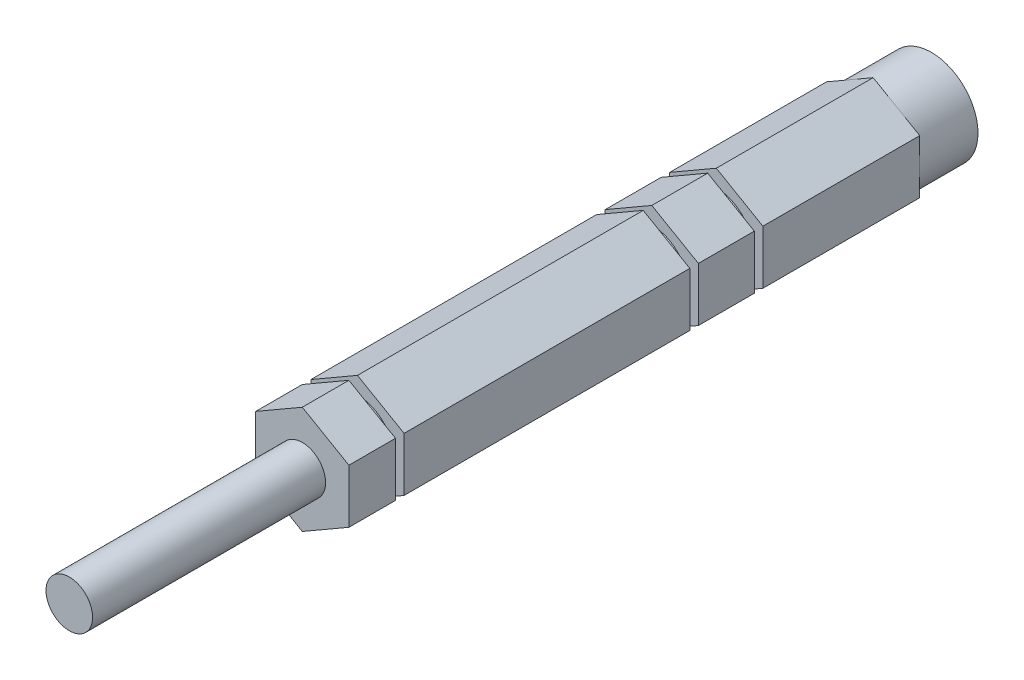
ISO-10303-21;
HEADER;
FILE_DESCRIPTION(('STEP AP214'),'2;1');
FILE_NAME('part.step','',(''),(''),'','','');
FILE_SCHEMA(('AUTOMOTIVE_DESIGN { 1 0 10303 214 1 1 1 1 }'));
ENDSEC;
DATA;
#1=APPLICATION_CONTEXT('core data for automotive mechanical design processes');
#2=APPLICATION_PROTOCOL_DEFINITION('international standard','automotive_design',2000,#1);
#3=PRODUCT_CONTEXT('',#1,'mechanical');
#4=PRODUCT('Part','Part','',(#3));
#5=PRODUCT_RELATED_PRODUCT_CATEGORY('part','',(#4));
#6=PRODUCT_DEFINITION_FORMATION('','',#4);
#7=PRODUCT_DEFINITION_CONTEXT('part definition',#1,'design');
#8=PRODUCT_DEFINITION('design','',#6,#7);
#9=PRODUCT_DEFINITION_SHAPE('','',#8);
#10=(LENGTH_UNIT() NAMED_UNIT(*) SI_UNIT(.MILLI.,.METRE.));
#11=(NAMED_UNIT(*) PLANE_ANGLE_UNIT() SI_UNIT($,.RADIAN.));
#12=(NAMED_UNIT(*) SI_UNIT($,.STERADIAN.) SOLID_ANGLE_UNIT());
#13=UNCERTAINTY_MEASURE_WITH_UNIT(LENGTH_MEASURE(1.E-05),#10,'distance_accuracy_value','');
#14=(GEOMETRIC_REPRESENTATION_CONTEXT(3) GLOBAL_UNCERTAINTY_ASSIGNED_CONTEXT((#13)) GLOBAL_UNIT_ASSIGNED_CONTEXT((#10,
#11,#12)) REPRESENTATION_CONTEXT('',''));
#15=CARTESIAN_POINT('',(0.,0.,0.));
#16=DIRECTION('',(0.,0.,1.));
#17=DIRECTION('',(1.,0.,0.));
#18=AXIS2_PLACEMENT_3D('',#15,#16,#17);
#19=CARTESIAN_POINT('',(6.35,3.66617420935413,117.475));
#20=DIRECTION('',(-0.5,-0.866025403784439,0.));
#21=DIRECTION('',(0.866025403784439,-0.5,0.));
#22=AXIS2_PLACEMENT_3D('',#19,#20,#21);
#23=PLANE('',#22);
#24=DIRECTION('',(-0.866025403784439,0.5,0.));
#25=VECTOR('',#24,1.);
#26=CARTESIAN_POINT('',(6.35,3.66617420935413,78.2066));
#27=LINE('',#26,#25);
#28=CARTESIAN_POINT('',(6.35,3.66617420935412,78.2066));
#29=VERTEX_POINT('',#28);
#30=CARTESIAN_POINT('',(0.,7.33234841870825,78.2066));
#31=VERTEX_POINT('',#30);
#32=EDGE_CURVE('E50',#29,#31,#27,.T.);
#33=ORIENTED_EDGE('',*,*,#32,.F.);
#34=DIRECTION('',(0.,0.,-1.));
#35=VECTOR('',#34,1.);
#36=CARTESIAN_POINT('',(6.35,3.66617420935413,117.475));
#37=LINE('',#36,#35);
#38=CARTESIAN_POINT('',(6.35,3.66617420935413,39.2684));
#39=VERTEX_POINT('',#38);
#40=EDGE_CURVE('E271',#29,#39,#37,.T.);
#41=ORIENTED_EDGE('',*,*,#40,.T.);
#42=DIRECTION('',(0.866025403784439,-0.5,0.));
#43=VECTOR('',#42,1.);
#44=CARTESIAN_POINT('',(6.35,3.66617420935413,39.2684));
#45=LINE('',#44,#43);
#46=CARTESIAN_POINT('',(0.,7.33234841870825,39.2684));
#47=VERTEX_POINT('',#46);
#48=EDGE_CURVE('E217',#47,#39,#45,.T.);
#49=ORIENTED_EDGE('',*,*,#48,.F.);
#50=DIRECTION('',(0.,0.,-1.));
#51=VECTOR('',#50,1.);
#52=CARTESIAN_POINT('',(0.,7.33234841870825,117.475));
#53=LINE('',#52,#51);
#54=EDGE_CURVE('E362',#31,#47,#53,.T.);
#55=ORIENTED_EDGE('',*,*,#54,.F.);
#56=EDGE_LOOP('',(#33,#41,#49,#55));
#57=FACE_BOUND('',#56,.T.);
#58=ADVANCED_FACE('F35',(#57),#23,.F.);
#59=CARTESIAN_POINT('',(6.35,-3.66617420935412,117.475));
#60=DIRECTION('',(-1.,0.,0.));
#61=DIRECTION('',(0.,-1.,0.));
#62=AXIS2_PLACEMENT_3D('',#59,#60,#61);
#63=PLANE('',#62);
#64=DIRECTION('',(0.,1.,0.));
#65=VECTOR('',#64,1.);
#66=CARTESIAN_POINT('',(6.35,-3.66617420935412,78.2066));
#67=LINE('',#66,#65);
#68=CARTESIAN_POINT('',(6.35,-3.66617420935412,78.2066));
#69=VERTEX_POINT('',#68);
#70=EDGE_CURVE('E473',#69,#29,#67,.T.);
#71=ORIENTED_EDGE('',*,*,#70,.F.);
#72=DIRECTION('',(0.,0.,-1.));
#73=VECTOR('',#72,1.);
#74=CARTESIAN_POINT('',(6.35,-3.66617420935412,117.475));
#75=LINE('',#74,#73);
#76=CARTESIAN_POINT('',(6.35,-3.66617420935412,39.2684));
#77=VERTEX_POINT('',#76);
#78=EDGE_CURVE('E273',#69,#77,#75,.T.);
#79=ORIENTED_EDGE('',*,*,#78,.T.);
#80=DIRECTION('',(0.,-1.,0.));
#81=VECTOR('',#80,1.);
#82=CARTESIAN_POINT('',(6.35,-3.66617420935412,39.2684));
#83=LINE('',#82,#81);
#84=EDGE_CURVE('E264',#39,#77,#83,.T.);
#85=ORIENTED_EDGE('',*,*,#84,.F.);
#86=ORIENTED_EDGE('',*,*,#40,.F.);
#87=EDGE_LOOP('',(#71,#79,#85,#86));
#88=FACE_BOUND('',#87,.T.);
#89=ADVANCED_FACE('F270',(#88),#63,.F.);
#90=CARTESIAN_POINT('',(0.,-7.33234841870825,117.475));
#91=DIRECTION('',(-0.5,0.866025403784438,0.));
#92=DIRECTION('',(-0.866025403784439,-0.5,0.));
#93=AXIS2_PLACEMENT_3D('',#90,#91,#92);
#94=PLANE('',#93);
#95=DIRECTION('',(0.866025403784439,0.5,0.));
#96=VECTOR('',#95,1.);
#97=CARTESIAN_POINT('',(0.,-7.33234841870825,78.2066));
#98=LINE('',#97,#96);
#99=CARTESIAN_POINT('',(0.,-7.33234841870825,78.2066));
#100=VERTEX_POINT('',#99);
#101=EDGE_CURVE('E477',#100,#69,#98,.T.);
#102=ORIENTED_EDGE('',*,*,#101,.F.);
#103=DIRECTION('',(0.,0.,-1.));
#104=VECTOR('',#103,1.);
#105=CARTESIAN_POINT('',(0.,-7.33234841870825,117.475));
#106=LINE('',#105,#104);
#107=CARTESIAN_POINT('',(0.,-7.33234841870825,39.2684));
#108=VERTEX_POINT('',#107);
#109=EDGE_CURVE('E374',#100,#108,#106,.T.);
#110=ORIENTED_EDGE('',*,*,#109,.T.);
#111=DIRECTION('',(-0.866025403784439,-0.5,0.));
#112=VECTOR('',#111,1.);
#113=CARTESIAN_POINT('',(0.,-7.33234841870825,39.2684));
#114=LINE('',#113,#112);
#115=EDGE_CURVE('E274',#77,#108,#114,.T.);
#116=ORIENTED_EDGE('',*,*,#115,.F.);
#117=ORIENTED_EDGE('',*,*,#78,.F.);
#118=EDGE_LOOP('',(#102,#110,#116,#117));
#119=FACE_BOUND('',#118,.T.);
#120=ADVANCED_FACE('F527',(#119),#94,.F.);
#121=CARTESIAN_POINT('',(-6.35,-3.66617420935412,117.475));
#122=DIRECTION('',(0.5,0.866025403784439,0.));
#123=DIRECTION('',(-0.866025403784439,0.5,0.));
#124=AXIS2_PLACEMENT_3D('',#121,#122,#123);
#125=PLANE('',#124);
#126=DIRECTION('',(0.866025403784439,-0.5,0.));
#127=VECTOR('',#126,1.);
#128=CARTESIAN_POINT('',(-6.35,-3.66617420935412,78.2066));
#129=LINE('',#128,#127);
#130=CARTESIAN_POINT('',(-6.35,-3.66617420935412,78.2066));
#131=VERTEX_POINT('',#130);
#132=EDGE_CURVE('E225',#131,#100,#129,.T.);
#133=ORIENTED_EDGE('',*,*,#132,.F.);
#134=DIRECTION('',(0.,0.,-1.));
#135=VECTOR('',#134,1.);
#136=CARTESIAN_POINT('',(-6.35,-3.66617420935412,117.475));
#137=LINE('',#136,#135);
#138=CARTESIAN_POINT('',(-6.35,-3.66617420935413,39.2684));
#139=VERTEX_POINT('',#138);
#140=EDGE_CURVE('E224',#131,#139,#137,.T.);
#141=ORIENTED_EDGE('',*,*,#140,.T.);
#142=DIRECTION('',(-0.866025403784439,0.5,0.));
#143=VECTOR('',#142,1.);
#144=CARTESIAN_POINT('',(-6.35,-3.66617420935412,39.2684));
#145=LINE('',#144,#143);
#146=EDGE_CURVE('E277',#108,#139,#145,.T.);
#147=ORIENTED_EDGE('',*,*,#146,.F.);
#148=ORIENTED_EDGE('',*,*,#109,.F.);
#149=EDGE_LOOP('',(#133,#141,#147,#148));
#150=FACE_BOUND('',#149,.T.);
#151=ADVANCED_FACE('F609',(#150),#125,.F.);
#152=CARTESIAN_POINT('',(-6.35,3.66617420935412,117.475));
#153=DIRECTION('',(1.,0.,0.));
#154=DIRECTION('',(0.,1.,0.));
#155=AXIS2_PLACEMENT_3D('',#152,#153,#154);
#156=PLANE('',#155);
#157=DIRECTION('',(0.,-1.,0.));
#158=VECTOR('',#157,1.);
#159=CARTESIAN_POINT('',(-6.35,3.66617420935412,78.2066));
#160=LINE('',#159,#158);
#161=CARTESIAN_POINT('',(-6.35,3.66617420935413,78.2066));
#162=VERTEX_POINT('',#161);
#163=EDGE_CURVE('E212',#162,#131,#160,.T.);
#164=ORIENTED_EDGE('',*,*,#163,.F.);
#165=DIRECTION('',(0.,0.,-1.));
#166=VECTOR('',#165,1.);
#167=CARTESIAN_POINT('',(-6.35,3.66617420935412,117.475));
#168=LINE('',#167,#166);
#169=CARTESIAN_POINT('',(-6.35,3.66617420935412,39.2684));
#170=VERTEX_POINT('',#169);
#171=EDGE_CURVE('E222',#162,#170,#168,.T.);
#172=ORIENTED_EDGE('',*,*,#171,.T.);
#173=DIRECTION('',(0.,1.,0.));
#174=VECTOR('',#173,1.);
#175=CARTESIAN_POINT('',(-6.35,3.66617420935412,39.2684));
#176=LINE('',#175,#174);
#177=EDGE_CURVE('E285',#139,#170,#176,.T.);
#178=ORIENTED_EDGE('',*,*,#177,.F.);
#179=ORIENTED_EDGE('',*,*,#140,.F.);
#180=EDGE_LOOP('',(#164,#172,#178,#179));
#181=FACE_BOUND('',#180,.T.);
#182=ADVANCED_FACE('F220',(#181),#156,.F.);
#183=CARTESIAN_POINT('',(0.,7.33234841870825,117.475));
#184=DIRECTION('',(0.5,-0.866025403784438,0.));
#185=DIRECTION('',(0.866025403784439,0.5,0.));
#186=AXIS2_PLACEMENT_3D('',#183,#184,#185);
#187=PLANE('',#186);
#188=DIRECTION('',(-0.866025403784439,-0.5,0.));
#189=VECTOR('',#188,1.);
#190=CARTESIAN_POINT('',(0.,7.33234841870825,78.2066));
#191=LINE('',#190,#189);
#192=EDGE_CURVE('E43',#31,#162,#191,.T.);
#193=ORIENTED_EDGE('',*,*,#192,.F.);
#194=ORIENTED_EDGE('',*,*,#54,.T.);
#195=DIRECTION('',(0.866025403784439,0.5,0.));
#196=VECTOR('',#195,1.);
#197=CARTESIAN_POINT('',(0.,7.33234841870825,39.2684));
#198=LINE('',#197,#196);
#199=EDGE_CURVE('E231',#170,#47,#198,.T.);
#200=ORIENTED_EDGE('',*,*,#199,.F.);
#201=ORIENTED_EDGE('',*,*,#171,.F.);
#202=EDGE_LOOP('',(#193,#194,#200,#201));
#203=FACE_BOUND('',#202,.T.);
#204=ADVANCED_FACE('F229',(#203),#187,.F.);
#205=DIRECTION('',(-0.866025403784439,-0.5,0.));
#206=VECTOR('',#205,1.);
#207=CARTESIAN_POINT('',(0.,7.33234841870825,38.1));
#208=LINE('',#207,#206);
#209=CARTESIAN_POINT('',(0.,7.33234841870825,38.1));
#210=VERTEX_POINT('',#209);
#211=CARTESIAN_POINT('',(-6.35,3.66617420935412,38.1));
#212=VERTEX_POINT('',#211);
#213=EDGE_CURVE('E275',#210,#212,#208,.T.);
#214=ORIENTED_EDGE('',*,*,#213,.F.);
#215=CARTESIAN_POINT('',(0.,7.33234841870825,30.48));
#216=VERTEX_POINT('',#215);
#217=EDGE_CURVE('E506',#210,#216,#53,.T.);
#218=ORIENTED_EDGE('',*,*,#217,.T.);
#219=DIRECTION('',(0.866025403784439,0.5,0.));
#220=VECTOR('',#219,1.);
#221=CARTESIAN_POINT('',(0.,7.33234841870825,30.48));
#222=LINE('',#221,#220);
#223=CARTESIAN_POINT('',(-6.35,3.66617420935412,30.48));
#224=VERTEX_POINT('',#223);
#225=EDGE_CURVE('E316',#224,#216,#222,.T.);
#226=ORIENTED_EDGE('',*,*,#225,.F.);
#227=EDGE_CURVE('E233',#212,#224,#168,.T.);
#228=ORIENTED_EDGE('',*,*,#227,.F.);
#229=EDGE_LOOP('',(#214,#218,#226,#228));
#230=FACE_BOUND('',#229,.T.);
#231=ADVANCED_FACE('F504',(#230),#187,.F.);
#232=DIRECTION('',(0.,-1.,0.));
#233=VECTOR('',#232,1.);
#234=CARTESIAN_POINT('',(-6.35,3.66617420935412,38.1));
#235=LINE('',#234,#233);
#236=CARTESIAN_POINT('',(-6.35,-3.66617420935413,38.1));
#237=VERTEX_POINT('',#236);
#238=EDGE_CURVE('E279',#212,#237,#235,.T.);
#239=ORIENTED_EDGE('',*,*,#238,.F.);
#240=ORIENTED_EDGE('',*,*,#227,.T.);
#241=DIRECTION('',(0.,1.,0.));
#242=VECTOR('',#241,1.);
#243=CARTESIAN_POINT('',(-6.35,3.66617420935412,30.48));
#244=LINE('',#243,#242);
#245=CARTESIAN_POINT('',(-6.35,-3.66617420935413,30.48));
#246=VERTEX_POINT('',#245);
#247=EDGE_CURVE('E313',#246,#224,#244,.T.);
#248=ORIENTED_EDGE('',*,*,#247,.F.);
#249=EDGE_CURVE('E379',#237,#246,#137,.T.);
#250=ORIENTED_EDGE('',*,*,#249,.F.);
#251=EDGE_LOOP('',(#239,#240,#248,#250));
#252=FACE_BOUND('',#251,.T.);
#253=ADVANCED_FACE('F501',(#252),#156,.F.);
#254=DIRECTION('',(0.866025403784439,-0.5,0.));
#255=VECTOR('',#254,1.);
#256=CARTESIAN_POINT('',(-6.35,-3.66617420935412,38.1));
#257=LINE('',#256,#255);
#258=CARTESIAN_POINT('',(0.,-7.33234841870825,38.1));
#259=VERTEX_POINT('',#258);
#260=EDGE_CURVE('E402',#237,#259,#257,.T.);
#261=ORIENTED_EDGE('',*,*,#260,.F.);
#262=ORIENTED_EDGE('',*,*,#249,.T.);
#263=DIRECTION('',(-0.866025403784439,0.5,0.));
#264=VECTOR('',#263,1.);
#265=CARTESIAN_POINT('',(-6.35,-3.66617420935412,30.48));
#266=LINE('',#265,#264);
#267=CARTESIAN_POINT('',(0.,-7.33234841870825,30.48));
#268=VERTEX_POINT('',#267);
#269=EDGE_CURVE('E310',#268,#246,#266,.T.);
#270=ORIENTED_EDGE('',*,*,#269,.F.);
#271=EDGE_CURVE('E380',#259,#268,#106,.T.);
#272=ORIENTED_EDGE('',*,*,#271,.F.);
#273=EDGE_LOOP('',(#261,#262,#270,#272));
#274=FACE_BOUND('',#273,.T.);
#275=ADVANCED_FACE('F400',(#274),#125,.F.);
#276=DIRECTION('',(0.866025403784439,0.5,0.));
#277=VECTOR('',#276,1.);
#278=CARTESIAN_POINT('',(0.,-7.33234841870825,38.1));
#279=LINE('',#278,#277);
#280=CARTESIAN_POINT('',(6.35,-3.66617420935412,38.1));
#281=VERTEX_POINT('',#280);
#282=EDGE_CURVE('E392',#259,#281,#279,.T.);
#283=ORIENTED_EDGE('',*,*,#282,.F.);
#284=ORIENTED_EDGE('',*,*,#271,.T.);
#285=DIRECTION('',(-0.866025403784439,-0.5,0.));
#286=VECTOR('',#285,1.);
#287=CARTESIAN_POINT('',(0.,-7.33234841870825,30.48));
#288=LINE('',#287,#286);
#289=CARTESIAN_POINT('',(6.35,-3.66617420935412,30.48));
#290=VERTEX_POINT('',#289);
#291=EDGE_CURVE('E307',#290,#268,#288,.T.);
#292=ORIENTED_EDGE('',*,*,#291,.F.);
#293=EDGE_CURVE('E515',#281,#290,#75,.T.);
#294=ORIENTED_EDGE('',*,*,#293,.F.);
#295=EDGE_LOOP('',(#283,#284,#292,#294));
#296=FACE_BOUND('',#295,.T.);
#297=ADVANCED_FACE('F390',(#296),#94,.F.);
#298=DIRECTION('',(0.,1.,0.));
#299=VECTOR('',#298,1.);
#300=CARTESIAN_POINT('',(6.35,-3.66617420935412,38.1));
#301=LINE('',#300,#299);
#302=CARTESIAN_POINT('',(6.35,3.66617420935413,38.1));
#303=VERTEX_POINT('',#302);
#304=EDGE_CURVE('E494',#281,#303,#301,.T.);
#305=ORIENTED_EDGE('',*,*,#304,.F.);
#306=ORIENTED_EDGE('',*,*,#293,.T.);
#307=DIRECTION('',(0.,-1.,0.));
#308=VECTOR('',#307,1.);
#309=CARTESIAN_POINT('',(6.35,-3.66617420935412,30.48));
#310=LINE('',#309,#308);
#311=CARTESIAN_POINT('',(6.35,3.66617420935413,30.48));
#312=VERTEX_POINT('',#311);
#313=EDGE_CURVE('E304',#312,#290,#310,.T.);
#314=ORIENTED_EDGE('',*,*,#313,.F.);
#315=EDGE_CURVE('E468',#303,#312,#37,.T.);
#316=ORIENTED_EDGE('',*,*,#315,.F.);
#317=EDGE_LOOP('',(#305,#306,#314,#316));
#318=FACE_BOUND('',#317,.T.);
#319=ADVANCED_FACE('F518',(#318),#63,.F.);
#320=DIRECTION('',(-0.866025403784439,0.5,0.));
#321=VECTOR('',#320,1.);
#322=CARTESIAN_POINT('',(6.35,3.66617420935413,38.1));
#323=LINE('',#322,#321);
#324=EDGE_CURVE('E255',#303,#210,#323,.T.);
#325=ORIENTED_EDGE('',*,*,#324,.F.);
#326=ORIENTED_EDGE('',*,*,#315,.T.);
#327=DIRECTION('',(0.866025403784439,-0.5,0.));
#328=VECTOR('',#327,1.);
#329=CARTESIAN_POINT('',(6.35,3.66617420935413,30.48));
#330=LINE('',#329,#328);
#331=EDGE_CURVE('E252',#216,#312,#330,.T.);
#332=ORIENTED_EDGE('',*,*,#331,.F.);
#333=ORIENTED_EDGE('',*,*,#217,.F.);
#334=EDGE_LOOP('',(#325,#326,#332,#333));
#335=FACE_BOUND('',#334,.T.);
#336=ADVANCED_FACE('F507',(#335),#23,.F.);
#337=CARTESIAN_POINT('',(6.35,-3.66617420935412,30.48));
#338=DIRECTION('',(0.,0.,-1.));
#339=DIRECTION('',(-1.,0.,0.));
#340=AXIS2_PLACEMENT_3D('',#337,#338,#339);
#341=PLANE('',#340);
#342=CARTESIAN_POINT('',(0.,0.,30.48));
#343=DIRECTION('',(0.,0.,-1.));
#344=DIRECTION('',(-1.,0.,0.));
#345=AXIS2_PLACEMENT_3D('',#342,#343,#344);
#346=CIRCLE('',#345,5.0292);
#347=CARTESIAN_POINT('',(-5.0292,0.,30.48));
#348=VERTEX_POINT('',#347);
#349=EDGE_CURVE('E291',#348,#348,#346,.T.);
#350=ORIENTED_EDGE('',*,*,#349,.F.);
#351=EDGE_LOOP('',(#350));
#352=FACE_BOUND('',#351,.T.);
#353=ORIENTED_EDGE('',*,*,#225,.T.);
#354=ORIENTED_EDGE('',*,*,#331,.T.);
#355=ORIENTED_EDGE('',*,*,#313,.T.);
#356=ORIENTED_EDGE('',*,*,#291,.T.);
#357=ORIENTED_EDGE('',*,*,#269,.T.);
#358=ORIENTED_EDGE('',*,*,#247,.T.);
#359=EDGE_LOOP('',(#353,#354,#355,#356,#357,#358));
#360=FACE_BOUND('',#359,.T.);
#361=ADVANCED_FACE('F397',(#352,#360),#341,.T.);
#362=CARTESIAN_POINT('',(6.35,-3.66617420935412,29.3116));
#363=DIRECTION('',(0.,0.,1.));
#364=DIRECTION('',(1.,0.,0.));
#365=AXIS2_PLACEMENT_3D('',#362,#363,#364);
#366=PLANE('',#365);
#367=CARTESIAN_POINT('',(0.,0.,29.3116));
#368=DIRECTION('',(0.,0.,-1.));
#369=DIRECTION('',(-1.,0.,0.));
#370=AXIS2_PLACEMENT_3D('',#367,#368,#369);
#371=CIRCLE('',#370,5.0292);
#372=CARTESIAN_POINT('',(-5.0292,0.,29.3116));
#373=VERTEX_POINT('',#372);
#374=EDGE_CURVE('E288',#373,#373,#371,.T.);
#375=ORIENTED_EDGE('',*,*,#374,.T.);
#376=EDGE_LOOP('',(#375));
#377=FACE_BOUND('',#376,.T.);
#378=DIRECTION('',(-0.866025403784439,-0.5,0.));
#379=VECTOR('',#378,1.);
#380=CARTESIAN_POINT('',(0.,7.33234841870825,29.3116));
#381=LINE('',#380,#379);
#382=CARTESIAN_POINT('',(0.,7.33234841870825,29.3116));
#383=VERTEX_POINT('',#382);
#384=CARTESIAN_POINT('',(-6.35,3.66617420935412,29.3116));
#385=VERTEX_POINT('',#384);
#386=EDGE_CURVE('E302',#383,#385,#381,.T.);
#387=ORIENTED_EDGE('',*,*,#386,.T.);
#388=DIRECTION('',(0.,-1.,0.));
#389=VECTOR('',#388,1.);
#390=CARTESIAN_POINT('',(-6.35,3.66617420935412,29.3116));
#391=LINE('',#390,#389);
#392=CARTESIAN_POINT('',(-6.35,-3.66617420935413,29.3116));
#393=VERTEX_POINT('',#392);
#394=EDGE_CURVE('E300',#385,#393,#391,.T.);
#395=ORIENTED_EDGE('',*,*,#394,.T.);
#396=DIRECTION('',(0.866025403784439,-0.5,0.));
#397=VECTOR('',#396,1.);
#398=CARTESIAN_POINT('',(-6.35,-3.66617420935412,29.3116));
#399=LINE('',#398,#397);
#400=CARTESIAN_POINT('',(0.,-7.33234841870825,29.3116));
#401=VERTEX_POINT('',#400);
#402=EDGE_CURVE('E298',#393,#401,#399,.T.);
#403=ORIENTED_EDGE('',*,*,#402,.T.);
#404=DIRECTION('',(0.866025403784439,0.5,0.));
#405=VECTOR('',#404,1.);
#406=CARTESIAN_POINT('',(0.,-7.33234841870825,29.3116));
#407=LINE('',#406,#405);
#408=CARTESIAN_POINT('',(6.35,-3.66617420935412,29.3116));
#409=VERTEX_POINT('',#408);
#410=EDGE_CURVE('E296',#401,#409,#407,.T.);
#411=ORIENTED_EDGE('',*,*,#410,.T.);
#412=DIRECTION('',(0.,1.,0.));
#413=VECTOR('',#412,1.);
#414=CARTESIAN_POINT('',(6.35,-3.66617420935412,29.3116));
#415=LINE('',#414,#413);
#416=CARTESIAN_POINT('',(6.35,3.66617420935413,29.3116));
#417=VERTEX_POINT('',#416);
#418=EDGE_CURVE('E294',#409,#417,#415,.T.);
#419=ORIENTED_EDGE('',*,*,#418,.T.);
#420=DIRECTION('',(-0.866025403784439,0.5,0.));
#421=VECTOR('',#420,1.);
#422=CARTESIAN_POINT('',(6.35,3.66617420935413,29.3116));
#423=LINE('',#422,#421);
#424=EDGE_CURVE('E250',#417,#383,#423,.T.);
#425=ORIENTED_EDGE('',*,*,#424,.T.);
#426=EDGE_LOOP('',(#387,#395,#403,#411,#419,#425));
#427=FACE_BOUND('',#426,.T.);
#428=ADVANCED_FACE('F513',(#377,#427),#366,.T.);
#429=CARTESIAN_POINT('',(0.,0.,0.));
#430=DIRECTION('',(0.,0.,-1.));
#431=DIRECTION('',(-1.,0.,0.));
#432=AXIS2_PLACEMENT_3D('',#429,#430,#431);
#433=CYLINDRICAL_SURFACE('',#432,5.0292);
#434=ORIENTED_EDGE('',*,*,#349,.T.);
#435=EDGE_LOOP('',(#434));
#436=FACE_BOUND('',#435,.T.);
#437=ORIENTED_EDGE('',*,*,#374,.F.);
#438=EDGE_LOOP('',(#437));
#439=FACE_BOUND('',#438,.T.);
#440=ADVANCED_FACE('F570',(#436,#439),#433,.T.);
#441=CARTESIAN_POINT('',(0.,0.,0.));
#442=DIRECTION('',(0.,0.,1.));
#443=DIRECTION('',(1.,0.,0.));
#444=AXIS2_PLACEMENT_3D('',#441,#442,#443);
#445=PLANE('',#444);
#446=CARTESIAN_POINT('',(0.,0.,0.));
#447=DIRECTION('',(0.,0.,1.));
#448=DIRECTION('',(1.,0.,0.));
#449=AXIS2_PLACEMENT_3D('',#446,#447,#448);
#450=CIRCLE('',#449,6.35);
#451=CARTESIAN_POINT('',(6.35,0.,0.));
#452=VERTEX_POINT('',#451);
#453=EDGE_CURVE('E236',#452,#452,#450,.T.);
#454=ORIENTED_EDGE('',*,*,#453,.F.);
#455=EDGE_LOOP('',(#454));
#456=FACE_BOUND('',#455,.T.);
#457=ADVANCED_FACE('F565',(#456),#445,.F.);
#458=CARTESIAN_POINT('',(0.,0.,0.));
#459=DIRECTION('',(0.,0.,-1.));
#460=DIRECTION('',(-1.,0.,0.));
#461=AXIS2_PLACEMENT_3D('',#458,#459,#460);
#462=CYLINDRICAL_SURFACE('',#461,6.35);
#463=ORIENTED_EDGE('',*,*,#453,.T.);
#464=EDGE_LOOP('',(#463));
#465=FACE_BOUND('',#464,.T.);
#466=CARTESIAN_POINT('',(0.,0.,7.9375));
#467=DIRECTION('',(0.,0.,-1.));
#468=DIRECTION('',(-1.,0.,0.));
#469=AXIS2_PLACEMENT_3D('',#466,#467,#468);
#470=CIRCLE('',#469,6.35);
#471=CARTESIAN_POINT('',(-6.35,0.,7.9375));
#472=VERTEX_POINT('',#471);
#473=CARTESIAN_POINT('',(-3.175,5.49926131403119,7.9375));
#474=VERTEX_POINT('',#473);
#475=EDGE_CURVE('E336',#472,#474,#470,.T.);
#476=ORIENTED_EDGE('',*,*,#475,.T.);
#477=CARTESIAN_POINT('',(3.175,5.49926131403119,7.9375));
#478=VERTEX_POINT('',#477);
#479=EDGE_CURVE('E340',#474,#478,#470,.T.);
#480=ORIENTED_EDGE('',*,*,#479,.T.);
#481=CARTESIAN_POINT('',(6.35,0.,7.9375));
#482=VERTEX_POINT('',#481);
#483=EDGE_CURVE('E453',#478,#482,#470,.T.);
#484=ORIENTED_EDGE('',*,*,#483,.T.);
#485=CARTESIAN_POINT('',(3.175,-5.49926131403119,7.9375));
#486=VERTEX_POINT('',#485);
#487=EDGE_CURVE('E436',#482,#486,#470,.T.);
#488=ORIENTED_EDGE('',*,*,#487,.T.);
#489=CARTESIAN_POINT('',(-3.175,-5.49926131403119,7.9375));
#490=VERTEX_POINT('',#489);
#491=EDGE_CURVE('E452',#486,#490,#470,.T.);
#492=ORIENTED_EDGE('',*,*,#491,.T.);
#493=EDGE_CURVE('E335',#490,#472,#470,.T.);
#494=ORIENTED_EDGE('',*,*,#493,.T.);
#495=EDGE_LOOP('',(#476,#480,#484,#488,#492,#494));
#496=FACE_BOUND('',#495,.T.);
#497=ADVANCED_FACE('F451',(#465,#496),#462,.T.);
#498=CARTESIAN_POINT('',(6.35,0.,7.9375));
#499=DIRECTION('',(0.,0.,-1.));
#500=DIRECTION('',(-1.,0.,0.));
#501=AXIS2_PLACEMENT_3D('',#498,#499,#500);
#502=PLANE('',#501);
#503=DIRECTION('',(0.,1.,0.));
#504=VECTOR('',#503,1.);
#505=CARTESIAN_POINT('',(-6.35,3.66617420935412,7.9375));
#506=LINE('',#505,#504);
#507=CARTESIAN_POINT('',(-6.35,3.66617420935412,7.9375));
#508=VERTEX_POINT('',#507);
#509=EDGE_CURVE('E349',#472,#508,#506,.T.);
#510=ORIENTED_EDGE('',*,*,#509,.T.);
#511=DIRECTION('',(0.866025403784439,0.5,0.));
#512=VECTOR('',#511,1.);
#513=CARTESIAN_POINT('',(0.,7.33234841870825,7.9375));
#514=LINE('',#513,#512);
#515=EDGE_CURVE('E346',#508,#474,#514,.T.);
#516=ORIENTED_EDGE('',*,*,#515,.T.);
#517=ORIENTED_EDGE('',*,*,#475,.F.);
#518=EDGE_LOOP('',(#510,#516,#517));
#519=FACE_BOUND('',#518,.T.);
#520=ADVANCED_FACE('F424',(#519),#502,.T.);
#521=DIRECTION('',(-0.866025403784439,0.5,0.));
#522=VECTOR('',#521,1.);
#523=CARTESIAN_POINT('',(-6.35,-3.66617420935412,7.9375));
#524=LINE('',#523,#522);
#525=CARTESIAN_POINT('',(-6.35,-3.66617420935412,7.9375));
#526=VERTEX_POINT('',#525);
#527=EDGE_CURVE('E354',#490,#526,#524,.T.);
#528=ORIENTED_EDGE('',*,*,#527,.T.);
#529=EDGE_CURVE('E353',#526,#472,#506,.T.);
#530=ORIENTED_EDGE('',*,*,#529,.T.);
#531=ORIENTED_EDGE('',*,*,#493,.F.);
#532=EDGE_LOOP('',(#528,#530,#531));
#533=FACE_BOUND('',#532,.T.);
#534=ADVANCED_FACE('F447',(#533),#502,.T.);
#535=CARTESIAN_POINT('',(0.,-7.33234841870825,7.9375));
#536=VERTEX_POINT('',#535);
#537=EDGE_CURVE('E357',#536,#490,#524,.T.);
#538=ORIENTED_EDGE('',*,*,#537,.T.);
#539=ORIENTED_EDGE('',*,*,#491,.F.);
#540=DIRECTION('',(-0.866025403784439,-0.5,0.));
#541=VECTOR('',#540,1.);
#542=CARTESIAN_POINT('',(0.,-7.33234841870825,7.9375));
#543=LINE('',#542,#541);
#544=EDGE_CURVE('E350',#486,#536,#543,.T.);
#545=ORIENTED_EDGE('',*,*,#544,.T.);
#546=EDGE_LOOP('',(#538,#539,#545));
#547=FACE_BOUND('',#546,.T.);
#548=ADVANCED_FACE('F508',(#547),#502,.T.);
#549=CARTESIAN_POINT('',(6.35,-3.66617420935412,7.9375));
#550=VERTEX_POINT('',#549);
#551=EDGE_CURVE('E347',#550,#486,#543,.T.);
#552=ORIENTED_EDGE('',*,*,#551,.T.);
#553=ORIENTED_EDGE('',*,*,#487,.F.);
#554=DIRECTION('',(0.,-1.,0.));
#555=VECTOR('',#554,1.);
#556=CARTESIAN_POINT('',(6.35,-3.66617420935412,7.9375));
#557=LINE('',#556,#555);
#558=EDGE_CURVE('E343',#482,#550,#557,.T.);
#559=ORIENTED_EDGE('',*,*,#558,.T.);
#560=EDGE_LOOP('',(#552,#553,#559));
#561=FACE_BOUND('',#560,.T.);
#562=ADVANCED_FACE('F433',(#561),#502,.T.);
#563=CARTESIAN_POINT('',(0.,7.33234841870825,7.9375));
#564=VERTEX_POINT('',#563);
#565=EDGE_CURVE('E342',#474,#564,#514,.T.);
#566=ORIENTED_EDGE('',*,*,#565,.T.);
#567=DIRECTION('',(0.866025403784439,-0.5,0.));
#568=VECTOR('',#567,1.);
#569=CARTESIAN_POINT('',(6.35,3.66617420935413,7.9375));
#570=LINE('',#569,#568);
#571=EDGE_CURVE('E247',#564,#478,#570,.T.);
#572=ORIENTED_EDGE('',*,*,#571,.T.);
#573=ORIENTED_EDGE('',*,*,#479,.F.);
#574=EDGE_LOOP('',(#566,#572,#573));
#575=FACE_BOUND('',#574,.T.);
#576=ADVANCED_FACE('F461',(#575),#502,.T.);
#577=CARTESIAN_POINT('',(6.35,3.66617420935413,7.9375));
#578=VERTEX_POINT('',#577);
#579=EDGE_CURVE('E339',#578,#482,#557,.T.);
#580=ORIENTED_EDGE('',*,*,#579,.T.);
#581=ORIENTED_EDGE('',*,*,#483,.F.);
#582=EDGE_CURVE('E244',#478,#578,#570,.T.);
#583=ORIENTED_EDGE('',*,*,#582,.T.);
#584=EDGE_LOOP('',(#580,#581,#583));
#585=FACE_BOUND('',#584,.T.);
#586=ADVANCED_FACE('F458',(#585),#502,.T.);
#587=ORIENTED_EDGE('',*,*,#424,.F.);
#588=EDGE_CURVE('E361',#417,#578,#37,.T.);
#589=ORIENTED_EDGE('',*,*,#588,.T.);
#590=ORIENTED_EDGE('',*,*,#582,.F.);
#591=ORIENTED_EDGE('',*,*,#571,.F.);
#592=EDGE_CURVE('E363',#383,#564,#53,.T.);
#593=ORIENTED_EDGE('',*,*,#592,.F.);
#594=EDGE_LOOP('',(#587,#589,#590,#591,#593));
#595=FACE_BOUND('',#594,.T.);
#596=ADVANCED_FACE('F465',(#595),#23,.F.);
#597=ORIENTED_EDGE('',*,*,#418,.F.);
#598=EDGE_CURVE('E367',#409,#550,#75,.T.);
#599=ORIENTED_EDGE('',*,*,#598,.T.);
#600=ORIENTED_EDGE('',*,*,#558,.F.);
#601=ORIENTED_EDGE('',*,*,#579,.F.);
#602=ORIENTED_EDGE('',*,*,#588,.F.);
#603=EDGE_LOOP('',(#597,#599,#600,#601,#602));
#604=FACE_BOUND('',#603,.T.);
#605=ADVANCED_FACE('F514',(#604),#63,.F.);
#606=ORIENTED_EDGE('',*,*,#410,.F.);
#607=EDGE_CURVE('E370',#401,#536,#106,.T.);
#608=ORIENTED_EDGE('',*,*,#607,.T.);
#609=ORIENTED_EDGE('',*,*,#544,.F.);
#610=ORIENTED_EDGE('',*,*,#551,.F.);
#611=ORIENTED_EDGE('',*,*,#598,.F.);
#612=EDGE_LOOP('',(#606,#608,#609,#610,#611));
#613=FACE_BOUND('',#612,.T.);
#614=ADVANCED_FACE('F441',(#613),#94,.F.);
#615=ORIENTED_EDGE('',*,*,#402,.F.);
#616=EDGE_CURVE('E373',#393,#526,#137,.T.);
#617=ORIENTED_EDGE('',*,*,#616,.T.);
#618=ORIENTED_EDGE('',*,*,#527,.F.);
#619=ORIENTED_EDGE('',*,*,#537,.F.);
#620=ORIENTED_EDGE('',*,*,#607,.F.);
#621=EDGE_LOOP('',(#615,#617,#618,#619,#620));
#622=FACE_BOUND('',#621,.T.);
#623=ADVANCED_FACE('F511',(#622),#125,.F.);
#624=ORIENTED_EDGE('',*,*,#394,.F.);
#625=EDGE_CURVE('E237',#385,#508,#168,.T.);
#626=ORIENTED_EDGE('',*,*,#625,.T.);
#627=ORIENTED_EDGE('',*,*,#509,.F.);
#628=ORIENTED_EDGE('',*,*,#529,.F.);
#629=ORIENTED_EDGE('',*,*,#616,.F.);
#630=EDGE_LOOP('',(#624,#626,#627,#628,#629));
#631=FACE_BOUND('',#630,.T.);
#632=ADVANCED_FACE('F416',(#631),#156,.F.);
#633=ORIENTED_EDGE('',*,*,#386,.F.);
#634=ORIENTED_EDGE('',*,*,#592,.T.);
#635=ORIENTED_EDGE('',*,*,#565,.F.);
#636=ORIENTED_EDGE('',*,*,#515,.F.);
#637=ORIENTED_EDGE('',*,*,#625,.F.);
#638=EDGE_LOOP('',(#633,#634,#635,#636,#637));
#639=FACE_BOUND('',#638,.T.);
#640=ADVANCED_FACE('F427',(#639),#187,.F.);
#641=CARTESIAN_POINT('',(6.35,-3.66617420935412,39.2684));
#642=DIRECTION('',(0.,0.,-1.));
#643=DIRECTION('',(-1.,0.,0.));
#644=AXIS2_PLACEMENT_3D('',#641,#642,#643);
#645=PLANE('',#644);
#646=CARTESIAN_POINT('',(0.,0.,39.2684));
#647=DIRECTION('',(0.,0.,-1.));
#648=DIRECTION('',(-1.,0.,0.));
#649=AXIS2_PLACEMENT_3D('',#646,#647,#648);
#650=CIRCLE('',#649,5.02920000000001);
#651=CARTESIAN_POINT('',(-5.02920000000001,0.,39.2684));
#652=VERTEX_POINT('',#651);
#653=EDGE_CURVE('E491',#652,#652,#650,.T.);
#654=ORIENTED_EDGE('',*,*,#653,.F.);
#655=EDGE_LOOP('',(#654));
#656=FACE_BOUND('',#655,.T.);
#657=ORIENTED_EDGE('',*,*,#199,.T.);
#658=ORIENTED_EDGE('',*,*,#48,.T.);
#659=ORIENTED_EDGE('',*,*,#84,.T.);
#660=ORIENTED_EDGE('',*,*,#115,.T.);
#661=ORIENTED_EDGE('',*,*,#146,.T.);
#662=ORIENTED_EDGE('',*,*,#177,.T.);
#663=EDGE_LOOP('',(#657,#658,#659,#660,#661,#662));
#664=FACE_BOUND('',#663,.T.);
#665=ADVANCED_FACE('F262',(#656,#664),#645,.T.);
#666=CARTESIAN_POINT('',(6.35,-3.66617420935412,38.1));
#667=DIRECTION('',(0.,0.,1.));
#668=DIRECTION('',(1.,0.,0.));
#669=AXIS2_PLACEMENT_3D('',#666,#667,#668);
#670=PLANE('',#669);
#671=CARTESIAN_POINT('',(0.,0.,38.1));
#672=DIRECTION('',(0.,0.,-1.));
#673=DIRECTION('',(-1.,0.,0.));
#674=AXIS2_PLACEMENT_3D('',#671,#672,#673);
#675=CIRCLE('',#674,5.02920000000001);
#676=CARTESIAN_POINT('',(-5.02920000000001,0.,38.1));
#677=VERTEX_POINT('',#676);
#678=EDGE_CURVE('E488',#677,#677,#675,.T.);
#679=ORIENTED_EDGE('',*,*,#678,.T.);
#680=EDGE_LOOP('',(#679));
#681=FACE_BOUND('',#680,.T.);
#682=ORIENTED_EDGE('',*,*,#213,.T.);
#683=ORIENTED_EDGE('',*,*,#238,.T.);
#684=ORIENTED_EDGE('',*,*,#260,.T.);
#685=ORIENTED_EDGE('',*,*,#282,.T.);
#686=ORIENTED_EDGE('',*,*,#304,.T.);
#687=ORIENTED_EDGE('',*,*,#324,.T.);
#688=EDGE_LOOP('',(#682,#683,#684,#685,#686,#687));
#689=FACE_BOUND('',#688,.T.);
#690=ADVANCED_FACE('F498',(#681,#689),#670,.T.);
#691=CARTESIAN_POINT('',(0.,0.,0.));
#692=DIRECTION('',(0.,0.,-1.));
#693=DIRECTION('',(-1.,0.,0.));
#694=AXIS2_PLACEMENT_3D('',#691,#692,#693);
#695=CYLINDRICAL_SURFACE('',#694,5.02920000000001);
#696=ORIENTED_EDGE('',*,*,#653,.T.);
#697=EDGE_LOOP('',(#696));
#698=FACE_BOUND('',#697,.T.);
#699=ORIENTED_EDGE('',*,*,#678,.F.);
#700=EDGE_LOOP('',(#699));
#701=FACE_BOUND('',#700,.T.);
#702=ADVANCED_FACE('F645',(#698,#701),#695,.T.);
#703=CARTESIAN_POINT('',(6.35,-3.66617420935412,79.375));
#704=DIRECTION('',(0.,0.,-1.));
#705=DIRECTION('',(-1.,0.,0.));
#706=AXIS2_PLACEMENT_3D('',#703,#704,#705);
#707=PLANE('',#706);
#708=CARTESIAN_POINT('',(0.,0.,79.375));
#709=DIRECTION('',(0.,0.,-1.));
#710=DIRECTION('',(-1.,0.,0.));
#711=AXIS2_PLACEMENT_3D('',#708,#709,#710);
#712=CIRCLE('',#711,5.02920000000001);
#713=CARTESIAN_POINT('',(-5.02920000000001,0.,79.375));
#714=VERTEX_POINT('',#713);
#715=EDGE_CURVE('E226',#714,#714,#712,.T.);
#716=ORIENTED_EDGE('',*,*,#715,.F.);
#717=EDGE_LOOP('',(#716));
#718=FACE_BOUND('',#717,.T.);
#719=DIRECTION('',(0.866025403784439,-0.5,0.));
#720=VECTOR('',#719,1.);
#721=CARTESIAN_POINT('',(6.35,3.66617420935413,79.375));
#722=LINE('',#721,#720);
#723=CARTESIAN_POINT('',(0.,7.33234841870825,79.375));
#724=VERTEX_POINT('',#723);
#725=CARTESIAN_POINT('',(6.35,3.66617420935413,79.375));
#726=VERTEX_POINT('',#725);
#727=EDGE_CURVE('E486',#724,#726,#722,.T.);
#728=ORIENTED_EDGE('',*,*,#727,.T.);
#729=DIRECTION('',(0.,-1.,0.));
#730=VECTOR('',#729,1.);
#731=CARTESIAN_POINT('',(6.35,-3.66617420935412,79.375));
#732=LINE('',#731,#730);
#733=CARTESIAN_POINT('',(6.35,-3.66617420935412,79.375));
#734=VERTEX_POINT('',#733);
#735=EDGE_CURVE('E484',#726,#734,#732,.T.);
#736=ORIENTED_EDGE('',*,*,#735,.T.);
#737=DIRECTION('',(-0.866025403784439,-0.5,0.));
#738=VECTOR('',#737,1.);
#739=CARTESIAN_POINT('',(0.,-7.33234841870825,79.375));
#740=LINE('',#739,#738);
#741=CARTESIAN_POINT('',(0.,-7.33234841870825,79.375));
#742=VERTEX_POINT('',#741);
#743=EDGE_CURVE('E482',#734,#742,#740,.T.);
#744=ORIENTED_EDGE('',*,*,#743,.T.);
#745=DIRECTION('',(-0.866025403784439,0.5,0.));
#746=VECTOR('',#745,1.);
#747=CARTESIAN_POINT('',(-6.35,-3.66617420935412,79.375));
#748=LINE('',#747,#746);
#749=CARTESIAN_POINT('',(-6.35,-3.66617420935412,79.375));
#750=VERTEX_POINT('',#749);
#751=EDGE_CURVE('E475',#742,#750,#748,.T.);
#752=ORIENTED_EDGE('',*,*,#751,.T.);
#753=DIRECTION('',(0.,1.,0.));
#754=VECTOR('',#753,1.);
#755=CARTESIAN_POINT('',(-6.35,3.66617420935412,79.375));
#756=LINE('',#755,#754);
#757=CARTESIAN_POINT('',(-6.35,3.66617420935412,79.375));
#758=VERTEX_POINT('',#757);
#759=EDGE_CURVE('E57',#750,#758,#756,.T.);
#760=ORIENTED_EDGE('',*,*,#759,.T.);
#761=DIRECTION('',(0.866025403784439,0.5,0.));
#762=VECTOR('',#761,1.);
#763=CARTESIAN_POINT('',(0.,7.33234841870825,79.375));
#764=LINE('',#763,#762);
#765=EDGE_CURVE('E11',#758,#724,#764,.T.);
#766=ORIENTED_EDGE('',*,*,#765,.T.);
#767=EDGE_LOOP('',(#728,#736,#744,#752,#760,#766));
#768=FACE_BOUND('',#767,.T.);
#769=ADVANCED_FACE('F601',(#718,#768),#707,.T.);
#770=CARTESIAN_POINT('',(6.35,-3.66617420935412,78.2066));
#771=DIRECTION('',(0.,0.,1.));
#772=DIRECTION('',(1.,0.,0.));
#773=AXIS2_PLACEMENT_3D('',#770,#771,#772);
#774=PLANE('',#773);
#775=CARTESIAN_POINT('',(0.,0.,78.2066));
#776=DIRECTION('',(0.,0.,-1.));
#777=DIRECTION('',(-1.,0.,0.));
#778=AXIS2_PLACEMENT_3D('',#775,#776,#777);
#779=CIRCLE('',#778,5.02920000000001);
#780=CARTESIAN_POINT('',(-5.02920000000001,0.,78.2066));
#781=VERTEX_POINT('',#780);
#782=EDGE_CURVE('E886',#781,#781,#779,.T.);
#783=ORIENTED_EDGE('',*,*,#782,.T.);
#784=EDGE_LOOP('',(#783));
#785=FACE_BOUND('',#784,.T.);
#786=ORIENTED_EDGE('',*,*,#32,.T.);
#787=ORIENTED_EDGE('',*,*,#192,.T.);
#788=ORIENTED_EDGE('',*,*,#163,.T.);
#789=ORIENTED_EDGE('',*,*,#132,.T.);
#790=ORIENTED_EDGE('',*,*,#101,.T.);
#791=ORIENTED_EDGE('',*,*,#70,.T.);
#792=EDGE_LOOP('',(#786,#787,#788,#789,#790,#791));
#793=FACE_BOUND('',#792,.T.);
#794=ADVANCED_FACE('F211',(#785,#793),#774,.T.);
#795=CARTESIAN_POINT('',(0.,0.,0.));
#796=DIRECTION('',(0.,0.,-1.));
#797=DIRECTION('',(-1.,0.,0.));
#798=AXIS2_PLACEMENT_3D('',#795,#796,#797);
#799=CYLINDRICAL_SURFACE('',#798,5.02920000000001);
#800=ORIENTED_EDGE('',*,*,#715,.T.);
#801=EDGE_LOOP('',(#800));
#802=FACE_BOUND('',#801,.T.);
#803=ORIENTED_EDGE('',*,*,#782,.F.);
#804=EDGE_LOOP('',(#803));
#805=FACE_BOUND('',#804,.T.);
#806=ADVANCED_FACE('F576',(#802,#805),#799,.T.);
#807=CARTESIAN_POINT('',(0.,0.,117.475));
#808=DIRECTION('',(0.,0.,1.));
#809=DIRECTION('',(1.,0.,0.));
#810=AXIS2_PLACEMENT_3D('',#807,#808,#809);
#811=PLANE('',#810);
#812=CARTESIAN_POINT('',(0.,0.,117.475));
#813=DIRECTION('',(0.,0.,-1.));
#814=DIRECTION('',(-1.,0.,0.));
#815=AXIS2_PLACEMENT_3D('',#812,#813,#814);
#816=CIRCLE('',#815,3.175);
#817=CARTESIAN_POINT('',(-3.175,0.,117.475));
#818=VERTEX_POINT('',#817);
#819=EDGE_CURVE('E322',#818,#818,#816,.T.);
#820=ORIENTED_EDGE('',*,*,#819,.F.);
#821=EDGE_LOOP('',(#820));
#822=FACE_BOUND('',#821,.T.);
#823=ADVANCED_FACE('F573',(#822),#811,.T.);
#824=CARTESIAN_POINT('',(0.,0.,0.));
#825=DIRECTION('',(0.,0.,-1.));
#826=DIRECTION('',(-1.,0.,0.));
#827=AXIS2_PLACEMENT_3D('',#824,#825,#826);
#828=CYLINDRICAL_SURFACE('',#827,3.175);
#829=ORIENTED_EDGE('',*,*,#819,.T.);
#830=EDGE_LOOP('',(#829));
#831=FACE_BOUND('',#830,.T.);
#832=CARTESIAN_POINT('',(0.,0.,85.725));
#833=DIRECTION('',(0.,0.,-1.));
#834=DIRECTION('',(-1.,0.,0.));
#835=AXIS2_PLACEMENT_3D('',#832,#833,#834);
#836=CIRCLE('',#835,3.175);
#837=CARTESIAN_POINT('',(-3.175,0.,85.725));
#838=VERTEX_POINT('',#837);
#839=EDGE_CURVE('E319',#838,#838,#836,.T.);
#840=ORIENTED_EDGE('',*,*,#839,.F.);
#841=EDGE_LOOP('',(#840));
#842=FACE_BOUND('',#841,.T.);
#843=ADVANCED_FACE('F575',(#831,#842),#828,.T.);
#844=CARTESIAN_POINT('',(3.175,0.,85.725));
#845=DIRECTION('',(0.,0.,1.));
#846=DIRECTION('',(1.,0.,0.));
#847=AXIS2_PLACEMENT_3D('',#844,#845,#846);
#848=PLANE('',#847);
#849=ORIENTED_EDGE('',*,*,#839,.T.);
#850=EDGE_LOOP('',(#849));
#851=FACE_BOUND('',#850,.T.);
#852=DIRECTION('',(-0.866025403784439,-0.5,0.));
#853=VECTOR('',#852,1.);
#854=CARTESIAN_POINT('',(0.,7.33234841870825,85.725));
#855=LINE('',#854,#853);
#856=CARTESIAN_POINT('',(0.,7.33234841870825,85.725));
#857=VERTEX_POINT('',#856);
#858=CARTESIAN_POINT('',(-6.35,3.66617420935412,85.725));
#859=VERTEX_POINT('',#858);
#860=EDGE_CURVE('E333',#857,#859,#855,.T.);
#861=ORIENTED_EDGE('',*,*,#860,.T.);
#862=DIRECTION('',(0.,-1.,0.));
#863=VECTOR('',#862,1.);
#864=CARTESIAN_POINT('',(-6.35,3.66617420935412,85.725));
#865=LINE('',#864,#863);
#866=CARTESIAN_POINT('',(-6.35,-3.66617420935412,85.725));
#867=VERTEX_POINT('',#866);
#868=EDGE_CURVE('E331',#859,#867,#865,.T.);
#869=ORIENTED_EDGE('',*,*,#868,.T.);
#870=DIRECTION('',(0.866025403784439,-0.5,0.));
#871=VECTOR('',#870,1.);
#872=CARTESIAN_POINT('',(-6.35,-3.66617420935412,85.725));
#873=LINE('',#872,#871);
#874=CARTESIAN_POINT('',(0.,-7.33234841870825,85.725));
#875=VERTEX_POINT('',#874);
#876=EDGE_CURVE('E329',#867,#875,#873,.T.);
#877=ORIENTED_EDGE('',*,*,#876,.T.);
#878=DIRECTION('',(0.866025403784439,0.5,0.));
#879=VECTOR('',#878,1.);
#880=CARTESIAN_POINT('',(0.,-7.33234841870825,85.725));
#881=LINE('',#880,#879);
#882=CARTESIAN_POINT('',(6.35,-3.66617420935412,85.725));
#883=VERTEX_POINT('',#882);
#884=EDGE_CURVE('E327',#875,#883,#881,.T.);
#885=ORIENTED_EDGE('',*,*,#884,.T.);
#886=DIRECTION('',(0.,1.,0.));
#887=VECTOR('',#886,1.);
#888=CARTESIAN_POINT('',(6.35,-3.66617420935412,85.725));
#889=LINE('',#888,#887);
#890=CARTESIAN_POINT('',(6.35,3.66617420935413,85.725));
#891=VERTEX_POINT('',#890);
#892=EDGE_CURVE('E325',#883,#891,#889,.T.);
#893=ORIENTED_EDGE('',*,*,#892,.T.);
#894=DIRECTION('',(-0.866025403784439,0.5,0.));
#895=VECTOR('',#894,1.);
#896=CARTESIAN_POINT('',(6.35,3.66617420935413,85.725));
#897=LINE('',#896,#895);
#898=EDGE_CURVE('E248',#891,#857,#897,.T.);
#899=ORIENTED_EDGE('',*,*,#898,.T.);
#900=EDGE_LOOP('',(#861,#869,#877,#885,#893,#899));
#901=FACE_BOUND('',#900,.T.);
#902=ADVANCED_FACE('F582',(#851,#901),#848,.T.);
#903=ORIENTED_EDGE('',*,*,#765,.F.);
#904=EDGE_CURVE('E232',#859,#758,#168,.T.);
#905=ORIENTED_EDGE('',*,*,#904,.F.);
#906=ORIENTED_EDGE('',*,*,#860,.F.);
#907=EDGE_CURVE('E358',#857,#724,#53,.T.);
#908=ORIENTED_EDGE('',*,*,#907,.T.);
#909=EDGE_LOOP('',(#903,#905,#906,#908));
#910=FACE_BOUND('',#909,.T.);
#911=ADVANCED_FACE('F37',(#910),#187,.F.);
#912=ORIENTED_EDGE('',*,*,#759,.F.);
#913=EDGE_CURVE('E240',#867,#750,#137,.T.);
#914=ORIENTED_EDGE('',*,*,#913,.F.);
#915=ORIENTED_EDGE('',*,*,#868,.F.);
#916=ORIENTED_EDGE('',*,*,#904,.T.);
#917=EDGE_LOOP('',(#912,#914,#915,#916));
#918=FACE_BOUND('',#917,.T.);
#919=ADVANCED_FACE('F600',(#918),#156,.F.);
#920=ORIENTED_EDGE('',*,*,#751,.F.);
#921=EDGE_CURVE('E371',#875,#742,#106,.T.);
#922=ORIENTED_EDGE('',*,*,#921,.F.);
#923=ORIENTED_EDGE('',*,*,#876,.F.);
#924=ORIENTED_EDGE('',*,*,#913,.T.);
#925=EDGE_LOOP('',(#920,#922,#923,#924));
#926=FACE_BOUND('',#925,.T.);
#927=ADVANCED_FACE('F606',(#926),#125,.F.);
#928=ORIENTED_EDGE('',*,*,#743,.F.);
#929=EDGE_CURVE('E368',#883,#734,#75,.T.);
#930=ORIENTED_EDGE('',*,*,#929,.F.);
#931=ORIENTED_EDGE('',*,*,#884,.F.);
#932=ORIENTED_EDGE('',*,*,#921,.T.);
#933=EDGE_LOOP('',(#928,#930,#931,#932));
#934=FACE_BOUND('',#933,.T.);
#935=ADVANCED_FACE('F541',(#934),#94,.F.);
#936=ORIENTED_EDGE('',*,*,#735,.F.);
#937=EDGE_CURVE('E364',#891,#726,#37,.T.);
#938=ORIENTED_EDGE('',*,*,#937,.F.);
#939=ORIENTED_EDGE('',*,*,#892,.F.);
#940=ORIENTED_EDGE('',*,*,#929,.T.);
#941=EDGE_LOOP('',(#936,#938,#939,#940));
#942=FACE_BOUND('',#941,.T.);
#943=ADVANCED_FACE('F528',(#942),#63,.F.);
#944=ORIENTED_EDGE('',*,*,#727,.F.);
#945=ORIENTED_EDGE('',*,*,#907,.F.);
#946=ORIENTED_EDGE('',*,*,#898,.F.);
#947=ORIENTED_EDGE('',*,*,#937,.T.);
#948=EDGE_LOOP('',(#944,#945,#946,#947));
#949=FACE_BOUND('',#948,.T.);
#950=ADVANCED_FACE('F532',(#949),#23,.F.);
#951=CLOSED_SHELL('',(#58,#89,#120,#151,#182,#204,#231,#253,#275,#297,#319,#336,#361,#428,#440,
#457,#497,#520,#534,#548,#562,#576,#586,#596,#605,#614,#623,#632,#640,#665,#690,#702,#769,#794,
#806,#823,#843,#902,#911,#919,#927,#935,#943,#950));
#952=MANIFOLD_SOLID_BREP('B2',#951);
#953=ADVANCED_BREP_SHAPE_REPRESENTATION('',(#18,#952),#14);
#954=SHAPE_DEFINITION_REPRESENTATION(#9,#953);
ENDSEC;
END-ISO-10303-21;
